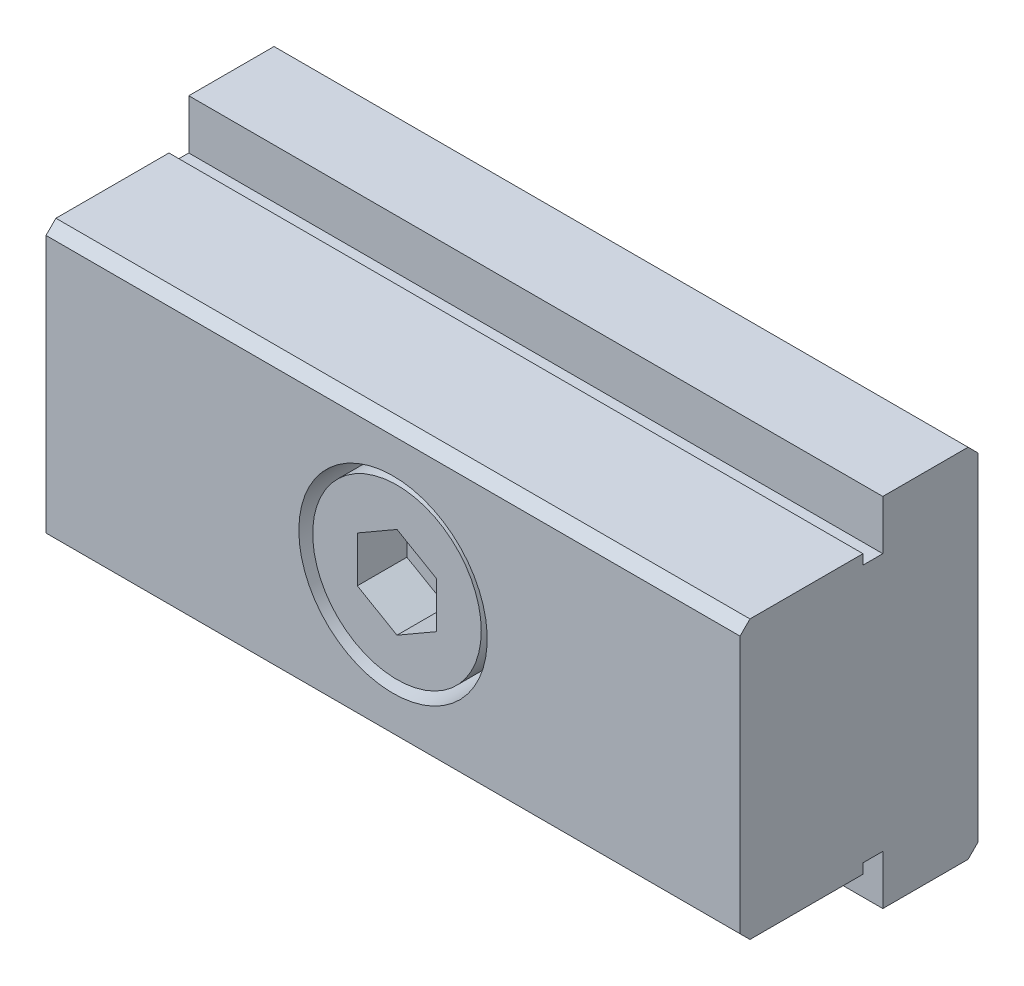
ISO-10303-21;
HEADER;
FILE_DESCRIPTION(('STEP AP214'),'2;1');
FILE_NAME('part.step','',(''),(''),'','','');
FILE_SCHEMA(('AUTOMOTIVE_DESIGN { 1 0 10303 214 1 1 1 1 }'));
ENDSEC;
DATA;
#1=APPLICATION_CONTEXT('core data for automotive mechanical design processes');
#2=APPLICATION_PROTOCOL_DEFINITION('international standard','automotive_design',2000,#1);
#3=PRODUCT_CONTEXT('',#1,'mechanical');
#4=PRODUCT('Part','Part','',(#3));
#5=PRODUCT_RELATED_PRODUCT_CATEGORY('part','',(#4));
#6=PRODUCT_DEFINITION_FORMATION('','',#4);
#7=PRODUCT_DEFINITION_CONTEXT('part definition',#1,'design');
#8=PRODUCT_DEFINITION('design','',#6,#7);
#9=PRODUCT_DEFINITION_SHAPE('','',#8);
#10=(LENGTH_UNIT() NAMED_UNIT(*) SI_UNIT(.MILLI.,.METRE.));
#11=(NAMED_UNIT(*) PLANE_ANGLE_UNIT() SI_UNIT($,.RADIAN.));
#12=(NAMED_UNIT(*) SI_UNIT($,.STERADIAN.) SOLID_ANGLE_UNIT());
#13=UNCERTAINTY_MEASURE_WITH_UNIT(LENGTH_MEASURE(1.E-05),#10,'distance_accuracy_value','');
#14=(GEOMETRIC_REPRESENTATION_CONTEXT(3) GLOBAL_UNCERTAINTY_ASSIGNED_CONTEXT((#13)) GLOBAL_UNIT_ASSIGNED_CONTEXT((#10,
#11,#12)) REPRESENTATION_CONTEXT('',''));
#15=CARTESIAN_POINT('',(0.,0.,0.));
#16=DIRECTION('',(0.,0.,1.));
#17=DIRECTION('',(1.,0.,0.));
#18=AXIS2_PLACEMENT_3D('',#15,#16,#17);
#19=CARTESIAN_POINT('',(17.5,6.5,7.2));
#20=DIRECTION('',(0.,-0.707106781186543,-0.707106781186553));
#21=DIRECTION('',(0.,0.707106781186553,-0.707106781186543));
#22=AXIS2_PLACEMENT_3D('',#19,#20,#21);
#23=PLANE('',#22);
#24=DIRECTION('',(0.,-0.707106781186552,0.707106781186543));
#25=VECTOR('',#24,1.);
#26=CARTESIAN_POINT('',(-17.5,6.5,7.2));
#27=LINE('',#26,#25);
#28=CARTESIAN_POINT('',(-17.5,7.,6.7));
#29=VERTEX_POINT('',#28);
#30=CARTESIAN_POINT('',(-17.5,6.5,7.2));
#31=VERTEX_POINT('',#30);
#32=EDGE_CURVE('E310',#29,#31,#27,.T.);
#33=ORIENTED_EDGE('',*,*,#32,.T.);
#34=DIRECTION('',(-1.,0.,0.));
#35=VECTOR('',#34,1.);
#36=CARTESIAN_POINT('',(17.5,6.5,7.2));
#37=LINE('',#36,#35);
#38=CARTESIAN_POINT('',(17.5,6.5,7.2));
#39=VERTEX_POINT('',#38);
#40=EDGE_CURVE('E24',#39,#31,#37,.T.);
#41=ORIENTED_EDGE('',*,*,#40,.F.);
#42=DIRECTION('',(0.,-0.707106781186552,0.707106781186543));
#43=VECTOR('',#42,1.);
#44=CARTESIAN_POINT('',(17.5,6.5,7.2));
#45=LINE('',#44,#43);
#46=CARTESIAN_POINT('',(17.5,7.,6.7));
#47=VERTEX_POINT('',#46);
#48=EDGE_CURVE('E341',#47,#39,#45,.T.);
#49=ORIENTED_EDGE('',*,*,#48,.F.);
#50=DIRECTION('',(-1.,0.,0.));
#51=VECTOR('',#50,1.);
#52=CARTESIAN_POINT('',(17.5,7.,6.7));
#53=LINE('',#52,#51);
#54=EDGE_CURVE('E197',#47,#29,#53,.T.);
#55=ORIENTED_EDGE('',*,*,#54,.T.);
#56=EDGE_LOOP('',(#33,#41,#49,#55));
#57=FACE_BOUND('',#56,.T.);
#58=ADVANCED_FACE('F14',(#57),#23,.F.);
#59=CARTESIAN_POINT('',(17.5,6.5,7.2));
#60=DIRECTION('',(0.,0.,-1.));
#61=DIRECTION('',(-1.,0.,0.));
#62=AXIS2_PLACEMENT_3D('',#59,#60,#61);
#63=PLANE('',#62);
#64=CARTESIAN_POINT('',(0.,0.,7.2));
#65=DIRECTION('',(0.,0.,-1.));
#66=DIRECTION('',(-1.,0.,0.));
#67=AXIS2_PLACEMENT_3D('',#64,#65,#66);
#68=CIRCLE('',#67,4.75);
#69=CARTESIAN_POINT('',(-4.75,0.,7.2));
#70=VERTEX_POINT('',#69);
#71=EDGE_CURVE('E307',#70,#70,#68,.T.);
#72=ORIENTED_EDGE('',*,*,#71,.T.);
#73=EDGE_LOOP('',(#72));
#74=FACE_BOUND('',#73,.T.);
#75=DIRECTION('',(0.,-1.,0.));
#76=VECTOR('',#75,1.);
#77=CARTESIAN_POINT('',(-17.5,6.5,7.2));
#78=LINE('',#77,#76);
#79=CARTESIAN_POINT('',(-17.5,-6.5,7.2));
#80=VERTEX_POINT('',#79);
#81=EDGE_CURVE('E86',#31,#80,#78,.T.);
#82=ORIENTED_EDGE('',*,*,#81,.T.);
#83=DIRECTION('',(-1.,0.,0.));
#84=VECTOR('',#83,1.);
#85=CARTESIAN_POINT('',(17.5,-6.5,7.2));
#86=LINE('',#85,#84);
#87=CARTESIAN_POINT('',(17.5,-6.5,7.2));
#88=VERTEX_POINT('',#87);
#89=EDGE_CURVE('E235',#88,#80,#86,.T.);
#90=ORIENTED_EDGE('',*,*,#89,.F.);
#91=DIRECTION('',(0.,-1.,0.));
#92=VECTOR('',#91,1.);
#93=CARTESIAN_POINT('',(17.5,6.5,7.2));
#94=LINE('',#93,#92);
#95=EDGE_CURVE('E343',#39,#88,#94,.T.);
#96=ORIENTED_EDGE('',*,*,#95,.F.);
#97=ORIENTED_EDGE('',*,*,#40,.T.);
#98=EDGE_LOOP('',(#82,#90,#96,#97));
#99=FACE_BOUND('',#98,.T.);
#100=ADVANCED_FACE('F385',(#74,#99),#63,.F.);
#101=CARTESIAN_POINT('',(17.5,-6.5,7.2));
#102=DIRECTION('',(0.,0.707106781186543,-0.707106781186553));
#103=DIRECTION('',(0.,0.707106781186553,0.707106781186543));
#104=AXIS2_PLACEMENT_3D('',#101,#102,#103);
#105=PLANE('',#104);
#106=DIRECTION('',(0.,-0.707106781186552,-0.707106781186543));
#107=VECTOR('',#106,1.);
#108=CARTESIAN_POINT('',(-17.5,-6.5,7.2));
#109=LINE('',#108,#107);
#110=CARTESIAN_POINT('',(-17.5,-7.,6.7));
#111=VERTEX_POINT('',#110);
#112=EDGE_CURVE('E314',#80,#111,#109,.T.);
#113=ORIENTED_EDGE('',*,*,#112,.T.);
#114=DIRECTION('',(-1.,0.,0.));
#115=VECTOR('',#114,1.);
#116=CARTESIAN_POINT('',(17.5,-7.,6.7));
#117=LINE('',#116,#115);
#118=CARTESIAN_POINT('',(17.5,-7.,6.7));
#119=VERTEX_POINT('',#118);
#120=EDGE_CURVE('E232',#119,#111,#117,.T.);
#121=ORIENTED_EDGE('',*,*,#120,.F.);
#122=DIRECTION('',(0.,-0.707106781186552,-0.707106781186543));
#123=VECTOR('',#122,1.);
#124=CARTESIAN_POINT('',(17.5,-6.5,7.2));
#125=LINE('',#124,#123);
#126=EDGE_CURVE('E345',#88,#119,#125,.T.);
#127=ORIENTED_EDGE('',*,*,#126,.F.);
#128=ORIENTED_EDGE('',*,*,#89,.T.);
#129=EDGE_LOOP('',(#113,#121,#127,#128));
#130=FACE_BOUND('',#129,.T.);
#131=ADVANCED_FACE('F387',(#130),#105,.F.);
#132=CARTESIAN_POINT('',(17.5,-7.,6.7));
#133=DIRECTION('',(0.,1.,0.));
#134=DIRECTION('',(-1.,0.,0.));
#135=AXIS2_PLACEMENT_3D('',#132,#133,#134);
#136=PLANE('',#135);
#137=DIRECTION('',(0.,0.,-1.));
#138=VECTOR('',#137,1.);
#139=CARTESIAN_POINT('',(-17.5,-7.,6.7));
#140=LINE('',#139,#138);
#141=CARTESIAN_POINT('',(-17.5,-7.,1.));
#142=VERTEX_POINT('',#141);
#143=EDGE_CURVE('E316',#111,#142,#140,.T.);
#144=ORIENTED_EDGE('',*,*,#143,.T.);
#145=DIRECTION('',(-1.,0.,0.));
#146=VECTOR('',#145,1.);
#147=CARTESIAN_POINT('',(17.5,-7.,1.));
#148=LINE('',#147,#146);
#149=CARTESIAN_POINT('',(17.5,-7.,1.));
#150=VERTEX_POINT('',#149);
#151=EDGE_CURVE('E229',#150,#142,#148,.T.);
#152=ORIENTED_EDGE('',*,*,#151,.F.);
#153=DIRECTION('',(0.,0.,-1.));
#154=VECTOR('',#153,1.);
#155=CARTESIAN_POINT('',(17.5,-7.,6.7));
#156=LINE('',#155,#154);
#157=EDGE_CURVE('E347',#119,#150,#156,.T.);
#158=ORIENTED_EDGE('',*,*,#157,.F.);
#159=ORIENTED_EDGE('',*,*,#120,.T.);
#160=EDGE_LOOP('',(#144,#152,#158,#159));
#161=FACE_BOUND('',#160,.T.);
#162=ADVANCED_FACE('F392',(#161),#136,.F.);
#163=CARTESIAN_POINT('',(17.5,-7.,1.));
#164=DIRECTION('',(0.,0.,1.));
#165=DIRECTION('',(1.,0.,0.));
#166=AXIS2_PLACEMENT_3D('',#163,#164,#165);
#167=PLANE('',#166);
#168=DIRECTION('',(0.,1.,0.));
#169=VECTOR('',#168,1.);
#170=CARTESIAN_POINT('',(-17.5,-7.,1.));
#171=LINE('',#170,#169);
#172=CARTESIAN_POINT('',(-17.5,-6.5,1.));
#173=VERTEX_POINT('',#172);
#174=EDGE_CURVE('E318',#142,#173,#171,.T.);
#175=ORIENTED_EDGE('',*,*,#174,.T.);
#176=DIRECTION('',(-1.,0.,0.));
#177=VECTOR('',#176,1.);
#178=CARTESIAN_POINT('',(17.5,-6.5,1.));
#179=LINE('',#178,#177);
#180=CARTESIAN_POINT('',(17.5,-6.5,1.));
#181=VERTEX_POINT('',#180);
#182=EDGE_CURVE('E226',#181,#173,#179,.T.);
#183=ORIENTED_EDGE('',*,*,#182,.F.);
#184=DIRECTION('',(0.,1.,0.));
#185=VECTOR('',#184,1.);
#186=CARTESIAN_POINT('',(17.5,-7.,1.));
#187=LINE('',#186,#185);
#188=EDGE_CURVE('E349',#150,#181,#187,.T.);
#189=ORIENTED_EDGE('',*,*,#188,.F.);
#190=ORIENTED_EDGE('',*,*,#151,.T.);
#191=EDGE_LOOP('',(#175,#183,#189,#190));
#192=FACE_BOUND('',#191,.T.);
#193=ADVANCED_FACE('F398',(#192),#167,.F.);
#194=CARTESIAN_POINT('',(17.5,-6.5,1.));
#195=DIRECTION('',(0.,1.,0.));
#196=DIRECTION('',(-1.,0.,0.));
#197=AXIS2_PLACEMENT_3D('',#194,#195,#196);
#198=PLANE('',#197);
#199=DIRECTION('',(0.,0.,-1.));
#200=VECTOR('',#199,1.);
#201=CARTESIAN_POINT('',(-17.5,-6.5,1.));
#202=LINE('',#201,#200);
#203=CARTESIAN_POINT('',(-17.5,-6.5,0.));
#204=VERTEX_POINT('',#203);
#205=EDGE_CURVE('E320',#173,#204,#202,.T.);
#206=ORIENTED_EDGE('',*,*,#205,.T.);
#207=DIRECTION('',(-1.,0.,0.));
#208=VECTOR('',#207,1.);
#209=CARTESIAN_POINT('',(17.5,-6.5,0.));
#210=LINE('',#209,#208);
#211=CARTESIAN_POINT('',(17.5,-6.5,0.));
#212=VERTEX_POINT('',#211);
#213=EDGE_CURVE('E223',#212,#204,#210,.T.);
#214=ORIENTED_EDGE('',*,*,#213,.F.);
#215=DIRECTION('',(0.,0.,-1.));
#216=VECTOR('',#215,1.);
#217=CARTESIAN_POINT('',(17.5,-6.5,1.));
#218=LINE('',#217,#216);
#219=EDGE_CURVE('E351',#181,#212,#218,.T.);
#220=ORIENTED_EDGE('',*,*,#219,.F.);
#221=ORIENTED_EDGE('',*,*,#182,.T.);
#222=EDGE_LOOP('',(#206,#214,#220,#221));
#223=FACE_BOUND('',#222,.T.);
#224=ADVANCED_FACE('F402',(#223),#198,.F.);
#225=CARTESIAN_POINT('',(17.5,-6.5,0.));
#226=DIRECTION('',(0.,0.,-1.));
#227=DIRECTION('',(-1.,0.,0.));
#228=AXIS2_PLACEMENT_3D('',#225,#226,#227);
#229=PLANE('',#228);
#230=DIRECTION('',(0.,-1.,0.));
#231=VECTOR('',#230,1.);
#232=CARTESIAN_POINT('',(-17.5,-6.5,0.));
#233=LINE('',#232,#231);
#234=CARTESIAN_POINT('',(-17.5,-9.,0.));
#235=VERTEX_POINT('',#234);
#236=EDGE_CURVE('E322',#204,#235,#233,.T.);
#237=ORIENTED_EDGE('',*,*,#236,.T.);
#238=DIRECTION('',(-1.,0.,0.));
#239=VECTOR('',#238,1.);
#240=CARTESIAN_POINT('',(17.5,-9.,0.));
#241=LINE('',#240,#239);
#242=CARTESIAN_POINT('',(17.5,-9.,0.));
#243=VERTEX_POINT('',#242);
#244=EDGE_CURVE('E220',#243,#235,#241,.T.);
#245=ORIENTED_EDGE('',*,*,#244,.F.);
#246=DIRECTION('',(0.,-1.,0.));
#247=VECTOR('',#246,1.);
#248=CARTESIAN_POINT('',(17.5,-6.5,0.));
#249=LINE('',#248,#247);
#250=EDGE_CURVE('E353',#212,#243,#249,.T.);
#251=ORIENTED_EDGE('',*,*,#250,.F.);
#252=ORIENTED_EDGE('',*,*,#213,.T.);
#253=EDGE_LOOP('',(#237,#245,#251,#252));
#254=FACE_BOUND('',#253,.T.);
#255=ADVANCED_FACE('F407',(#254),#229,.F.);
#256=CARTESIAN_POINT('',(17.5,-9.,0.));
#257=DIRECTION('',(0.,1.,0.));
#258=DIRECTION('',(-1.,0.,0.));
#259=AXIS2_PLACEMENT_3D('',#256,#257,#258);
#260=PLANE('',#259);
#261=DIRECTION('',(0.,0.,-1.));
#262=VECTOR('',#261,1.);
#263=CARTESIAN_POINT('',(-17.5,-9.,0.));
#264=LINE('',#263,#262);
#265=CARTESIAN_POINT('',(-17.5,-9.,-4.3));
#266=VERTEX_POINT('',#265);
#267=EDGE_CURVE('E324',#235,#266,#264,.T.);
#268=ORIENTED_EDGE('',*,*,#267,.T.);
#269=DIRECTION('',(-1.,0.,0.));
#270=VECTOR('',#269,1.);
#271=CARTESIAN_POINT('',(17.5,-9.,-4.3));
#272=LINE('',#271,#270);
#273=CARTESIAN_POINT('',(17.5,-9.,-4.3));
#274=VERTEX_POINT('',#273);
#275=EDGE_CURVE('E217',#274,#266,#272,.T.);
#276=ORIENTED_EDGE('',*,*,#275,.F.);
#277=DIRECTION('',(0.,0.,-1.));
#278=VECTOR('',#277,1.);
#279=CARTESIAN_POINT('',(17.5,-9.,0.));
#280=LINE('',#279,#278);
#281=EDGE_CURVE('E355',#243,#274,#280,.T.);
#282=ORIENTED_EDGE('',*,*,#281,.F.);
#283=ORIENTED_EDGE('',*,*,#244,.T.);
#284=EDGE_LOOP('',(#268,#276,#282,#283));
#285=FACE_BOUND('',#284,.T.);
#286=ADVANCED_FACE('F413',(#285),#260,.F.);
#287=CARTESIAN_POINT('',(17.5,-9.,-4.3));
#288=DIRECTION('',(0.,0.707106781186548,0.707106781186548));
#289=DIRECTION('',(0.,-0.707106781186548,0.707106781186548));
#290=AXIS2_PLACEMENT_3D('',#287,#288,#289);
#291=PLANE('',#290);
#292=DIRECTION('',(0.,0.707106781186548,-0.707106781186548));
#293=VECTOR('',#292,1.);
#294=CARTESIAN_POINT('',(-17.5,-9.,-4.3));
#295=LINE('',#294,#293);
#296=CARTESIAN_POINT('',(-17.5,-8.5,-4.8));
#297=VERTEX_POINT('',#296);
#298=EDGE_CURVE('E326',#266,#297,#295,.T.);
#299=ORIENTED_EDGE('',*,*,#298,.T.);
#300=DIRECTION('',(-1.,0.,0.));
#301=VECTOR('',#300,1.);
#302=CARTESIAN_POINT('',(17.5,-8.5,-4.8));
#303=LINE('',#302,#301);
#304=CARTESIAN_POINT('',(17.5,-8.5,-4.8));
#305=VERTEX_POINT('',#304);
#306=EDGE_CURVE('E214',#305,#297,#303,.T.);
#307=ORIENTED_EDGE('',*,*,#306,.F.);
#308=DIRECTION('',(0.,0.707106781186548,-0.707106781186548));
#309=VECTOR('',#308,1.);
#310=CARTESIAN_POINT('',(17.5,-9.,-4.3));
#311=LINE('',#310,#309);
#312=EDGE_CURVE('E357',#274,#305,#311,.T.);
#313=ORIENTED_EDGE('',*,*,#312,.F.);
#314=ORIENTED_EDGE('',*,*,#275,.T.);
#315=EDGE_LOOP('',(#299,#307,#313,#314));
#316=FACE_BOUND('',#315,.T.);
#317=ADVANCED_FACE('F417',(#316),#291,.F.);
#318=CARTESIAN_POINT('',(17.5,8.5,-4.8));
#319=DIRECTION('',(0.,0.,1.));
#320=DIRECTION('',(1.,0.,0.));
#321=AXIS2_PLACEMENT_3D('',#318,#319,#320);
#322=PLANE('',#321);
#323=CARTESIAN_POINT('',(0.,0.,-4.8));
#324=DIRECTION('',(0.,0.,-1.));
#325=DIRECTION('',(-1.,0.,0.));
#326=AXIS2_PLACEMENT_3D('',#323,#324,#325);
#327=CIRCLE('',#326,2.75);
#328=CARTESIAN_POINT('',(-2.75,0.,-4.8));
#329=VERTEX_POINT('',#328);
#330=EDGE_CURVE('E293',#329,#329,#327,.T.);
#331=ORIENTED_EDGE('',*,*,#330,.F.);
#332=EDGE_LOOP('',(#331));
#333=FACE_BOUND('',#332,.T.);
#334=DIRECTION('',(0.,1.,0.));
#335=VECTOR('',#334,1.);
#336=CARTESIAN_POINT('',(-17.5,8.5,-4.8));
#337=LINE('',#336,#335);
#338=CARTESIAN_POINT('',(-17.5,8.5,-4.8));
#339=VERTEX_POINT('',#338);
#340=EDGE_CURVE('E328',#297,#339,#337,.T.);
#341=ORIENTED_EDGE('',*,*,#340,.T.);
#342=DIRECTION('',(-1.,0.,0.));
#343=VECTOR('',#342,1.);
#344=CARTESIAN_POINT('',(17.5,8.5,-4.8));
#345=LINE('',#344,#343);
#346=CARTESIAN_POINT('',(17.5,8.5,-4.8));
#347=VERTEX_POINT('',#346);
#348=EDGE_CURVE('E211',#347,#339,#345,.T.);
#349=ORIENTED_EDGE('',*,*,#348,.F.);
#350=DIRECTION('',(0.,1.,0.));
#351=VECTOR('',#350,1.);
#352=CARTESIAN_POINT('',(17.5,8.5,-4.8));
#353=LINE('',#352,#351);
#354=EDGE_CURVE('E359',#305,#347,#353,.T.);
#355=ORIENTED_EDGE('',*,*,#354,.F.);
#356=ORIENTED_EDGE('',*,*,#306,.T.);
#357=EDGE_LOOP('',(#341,#349,#355,#356));
#358=FACE_BOUND('',#357,.T.);
#359=ADVANCED_FACE('F422',(#333,#358),#322,.F.);
#360=CARTESIAN_POINT('',(17.5,9.,-4.3));
#361=DIRECTION('',(0.,-0.707106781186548,0.707106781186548));
#362=DIRECTION('',(0.,-0.707106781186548,-0.707106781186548));
#363=AXIS2_PLACEMENT_3D('',#360,#361,#362);
#364=PLANE('',#363);
#365=DIRECTION('',(0.,0.707106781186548,0.707106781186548));
#366=VECTOR('',#365,1.);
#367=CARTESIAN_POINT('',(-17.5,9.,-4.3));
#368=LINE('',#367,#366);
#369=CARTESIAN_POINT('',(-17.5,9.,-4.3));
#370=VERTEX_POINT('',#369);
#371=EDGE_CURVE('E330',#339,#370,#368,.T.);
#372=ORIENTED_EDGE('',*,*,#371,.T.);
#373=DIRECTION('',(-1.,0.,0.));
#374=VECTOR('',#373,1.);
#375=CARTESIAN_POINT('',(17.5,9.,-4.3));
#376=LINE('',#375,#374);
#377=CARTESIAN_POINT('',(17.5,9.,-4.3));
#378=VERTEX_POINT('',#377);
#379=EDGE_CURVE('E208',#378,#370,#376,.T.);
#380=ORIENTED_EDGE('',*,*,#379,.F.);
#381=DIRECTION('',(0.,0.707106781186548,0.707106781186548));
#382=VECTOR('',#381,1.);
#383=CARTESIAN_POINT('',(17.5,9.,-4.3));
#384=LINE('',#383,#382);
#385=EDGE_CURVE('E361',#347,#378,#384,.T.);
#386=ORIENTED_EDGE('',*,*,#385,.F.);
#387=ORIENTED_EDGE('',*,*,#348,.T.);
#388=EDGE_LOOP('',(#372,#380,#386,#387));
#389=FACE_BOUND('',#388,.T.);
#390=ADVANCED_FACE('F425',(#389),#364,.F.);
#391=CARTESIAN_POINT('',(17.5,9.,0.));
#392=DIRECTION('',(0.,-1.,0.));
#393=DIRECTION('',(1.,0.,0.));
#394=AXIS2_PLACEMENT_3D('',#391,#392,#393);
#395=PLANE('',#394);
#396=DIRECTION('',(0.,0.,1.));
#397=VECTOR('',#396,1.);
#398=CARTESIAN_POINT('',(-17.5,9.,0.));
#399=LINE('',#398,#397);
#400=CARTESIAN_POINT('',(-17.5,9.,0.));
#401=VERTEX_POINT('',#400);
#402=EDGE_CURVE('E332',#370,#401,#399,.T.);
#403=ORIENTED_EDGE('',*,*,#402,.T.);
#404=DIRECTION('',(-1.,0.,0.));
#405=VECTOR('',#404,1.);
#406=CARTESIAN_POINT('',(17.5,9.,0.));
#407=LINE('',#406,#405);
#408=CARTESIAN_POINT('',(17.5,9.,0.));
#409=VERTEX_POINT('',#408);
#410=EDGE_CURVE('E205',#409,#401,#407,.T.);
#411=ORIENTED_EDGE('',*,*,#410,.F.);
#412=DIRECTION('',(0.,0.,1.));
#413=VECTOR('',#412,1.);
#414=CARTESIAN_POINT('',(17.5,9.,0.));
#415=LINE('',#414,#413);
#416=EDGE_CURVE('E363',#378,#409,#415,.T.);
#417=ORIENTED_EDGE('',*,*,#416,.F.);
#418=ORIENTED_EDGE('',*,*,#379,.T.);
#419=EDGE_LOOP('',(#403,#411,#417,#418));
#420=FACE_BOUND('',#419,.T.);
#421=ADVANCED_FACE('F369',(#420),#395,.F.);
#422=CARTESIAN_POINT('',(17.5,6.5,0.));
#423=DIRECTION('',(0.,0.,-1.));
#424=DIRECTION('',(-1.,0.,0.));
#425=AXIS2_PLACEMENT_3D('',#422,#423,#424);
#426=PLANE('',#425);
#427=DIRECTION('',(0.,-1.,0.));
#428=VECTOR('',#427,1.);
#429=CARTESIAN_POINT('',(-17.5,6.5,0.));
#430=LINE('',#429,#428);
#431=CARTESIAN_POINT('',(-17.5,6.5,0.));
#432=VERTEX_POINT('',#431);
#433=EDGE_CURVE('E334',#401,#432,#430,.T.);
#434=ORIENTED_EDGE('',*,*,#433,.T.);
#435=DIRECTION('',(-1.,0.,0.));
#436=VECTOR('',#435,1.);
#437=CARTESIAN_POINT('',(17.5,6.5,0.));
#438=LINE('',#437,#436);
#439=CARTESIAN_POINT('',(17.5,6.5,0.));
#440=VERTEX_POINT('',#439);
#441=EDGE_CURVE('E191',#440,#432,#438,.T.);
#442=ORIENTED_EDGE('',*,*,#441,.F.);
#443=DIRECTION('',(0.,-1.,0.));
#444=VECTOR('',#443,1.);
#445=CARTESIAN_POINT('',(17.5,6.5,0.));
#446=LINE('',#445,#444);
#447=EDGE_CURVE('E179',#409,#440,#446,.T.);
#448=ORIENTED_EDGE('',*,*,#447,.F.);
#449=ORIENTED_EDGE('',*,*,#410,.T.);
#450=EDGE_LOOP('',(#434,#442,#448,#449));
#451=FACE_BOUND('',#450,.T.);
#452=ADVANCED_FACE('F373',(#451),#426,.F.);
#453=CARTESIAN_POINT('',(17.5,6.5,1.));
#454=DIRECTION('',(0.,-1.,0.));
#455=DIRECTION('',(1.,0.,0.));
#456=AXIS2_PLACEMENT_3D('',#453,#454,#455);
#457=PLANE('',#456);
#458=DIRECTION('',(0.,0.,1.));
#459=VECTOR('',#458,1.);
#460=CARTESIAN_POINT('',(-17.5,6.5,1.));
#461=LINE('',#460,#459);
#462=CARTESIAN_POINT('',(-17.5,6.5,1.));
#463=VERTEX_POINT('',#462);
#464=EDGE_CURVE('E188',#432,#463,#461,.T.);
#465=ORIENTED_EDGE('',*,*,#464,.T.);
#466=DIRECTION('',(-1.,0.,0.));
#467=VECTOR('',#466,1.);
#468=CARTESIAN_POINT('',(17.5,6.5,1.));
#469=LINE('',#468,#467);
#470=CARTESIAN_POINT('',(17.5,6.5,1.));
#471=VERTEX_POINT('',#470);
#472=EDGE_CURVE('E185',#471,#463,#469,.T.);
#473=ORIENTED_EDGE('',*,*,#472,.F.);
#474=DIRECTION('',(0.,0.,1.));
#475=VECTOR('',#474,1.);
#476=CARTESIAN_POINT('',(17.5,6.5,1.));
#477=LINE('',#476,#475);
#478=EDGE_CURVE('E172',#440,#471,#477,.T.);
#479=ORIENTED_EDGE('',*,*,#478,.F.);
#480=ORIENTED_EDGE('',*,*,#441,.T.);
#481=EDGE_LOOP('',(#465,#473,#479,#480));
#482=FACE_BOUND('',#481,.T.);
#483=ADVANCED_FACE('F186',(#482),#457,.F.);
#484=CARTESIAN_POINT('',(17.5,7.,1.));
#485=DIRECTION('',(0.,0.,1.));
#486=DIRECTION('',(1.,0.,0.));
#487=AXIS2_PLACEMENT_3D('',#484,#485,#486);
#488=PLANE('',#487);
#489=DIRECTION('',(0.,1.,0.));
#490=VECTOR('',#489,1.);
#491=CARTESIAN_POINT('',(-17.5,7.,1.));
#492=LINE('',#491,#490);
#493=CARTESIAN_POINT('',(-17.5,7.,1.));
#494=VERTEX_POINT('',#493);
#495=EDGE_CURVE('E337',#463,#494,#492,.T.);
#496=ORIENTED_EDGE('',*,*,#495,.T.);
#497=DIRECTION('',(-1.,0.,0.));
#498=VECTOR('',#497,1.);
#499=CARTESIAN_POINT('',(17.5,7.,1.));
#500=LINE('',#499,#498);
#501=CARTESIAN_POINT('',(17.5,7.,1.));
#502=VERTEX_POINT('',#501);
#503=EDGE_CURVE('E192',#502,#494,#500,.T.);
#504=ORIENTED_EDGE('',*,*,#503,.F.);
#505=DIRECTION('',(0.,1.,0.));
#506=VECTOR('',#505,1.);
#507=CARTESIAN_POINT('',(17.5,7.,1.));
#508=LINE('',#507,#506);
#509=EDGE_CURVE('E176',#471,#502,#508,.T.);
#510=ORIENTED_EDGE('',*,*,#509,.F.);
#511=ORIENTED_EDGE('',*,*,#472,.T.);
#512=EDGE_LOOP('',(#496,#504,#510,#511));
#513=FACE_BOUND('',#512,.T.);
#514=ADVANCED_FACE('F194',(#513),#488,.F.);
#515=CARTESIAN_POINT('',(17.5,7.,6.7));
#516=DIRECTION('',(0.,-1.,0.));
#517=DIRECTION('',(1.,0.,0.));
#518=AXIS2_PLACEMENT_3D('',#515,#516,#517);
#519=PLANE('',#518);
#520=DIRECTION('',(0.,0.,1.));
#521=VECTOR('',#520,1.);
#522=CARTESIAN_POINT('',(-17.5,7.,6.7));
#523=LINE('',#522,#521);
#524=EDGE_CURVE('E339',#494,#29,#523,.T.);
#525=ORIENTED_EDGE('',*,*,#524,.T.);
#526=ORIENTED_EDGE('',*,*,#54,.F.);
#527=DIRECTION('',(0.,0.,1.));
#528=VECTOR('',#527,1.);
#529=CARTESIAN_POINT('',(17.5,7.,6.7));
#530=LINE('',#529,#528);
#531=EDGE_CURVE('E33',#502,#47,#530,.T.);
#532=ORIENTED_EDGE('',*,*,#531,.F.);
#533=ORIENTED_EDGE('',*,*,#503,.T.);
#534=EDGE_LOOP('',(#525,#526,#532,#533));
#535=FACE_BOUND('',#534,.T.);
#536=ADVANCED_FACE('F377',(#535),#519,.F.);
#537=CARTESIAN_POINT('',(17.5,13.5,0.200000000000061));
#538=DIRECTION('',(-1.,0.,0.));
#539=DIRECTION('',(0.,-1.,0.));
#540=AXIS2_PLACEMENT_3D('',#537,#538,#539);
#541=PLANE('',#540);
#542=ORIENTED_EDGE('',*,*,#48,.T.);
#543=ORIENTED_EDGE('',*,*,#95,.T.);
#544=ORIENTED_EDGE('',*,*,#126,.T.);
#545=ORIENTED_EDGE('',*,*,#157,.T.);
#546=ORIENTED_EDGE('',*,*,#188,.T.);
#547=ORIENTED_EDGE('',*,*,#219,.T.);
#548=ORIENTED_EDGE('',*,*,#250,.T.);
#549=ORIENTED_EDGE('',*,*,#281,.T.);
#550=ORIENTED_EDGE('',*,*,#312,.T.);
#551=ORIENTED_EDGE('',*,*,#354,.T.);
#552=ORIENTED_EDGE('',*,*,#385,.T.);
#553=ORIENTED_EDGE('',*,*,#416,.T.);
#554=ORIENTED_EDGE('',*,*,#447,.T.);
#555=ORIENTED_EDGE('',*,*,#478,.T.);
#556=ORIENTED_EDGE('',*,*,#509,.T.);
#557=ORIENTED_EDGE('',*,*,#531,.T.);
#558=EDGE_LOOP('',(#542,#543,#544,#545,#546,#547,#548,#549,#550,#551,#552,#553,#554,#555,#556,#557));
#559=FACE_BOUND('',#558,.T.);
#560=ADVANCED_FACE('F174',(#559),#541,.F.);
#561=CARTESIAN_POINT('',(-17.5,13.5,0.200000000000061));
#562=DIRECTION('',(-1.,0.,0.));
#563=DIRECTION('',(0.,-1.,0.));
#564=AXIS2_PLACEMENT_3D('',#561,#562,#563);
#565=PLANE('',#564);
#566=ORIENTED_EDGE('',*,*,#32,.F.);
#567=ORIENTED_EDGE('',*,*,#524,.F.);
#568=ORIENTED_EDGE('',*,*,#495,.F.);
#569=ORIENTED_EDGE('',*,*,#464,.F.);
#570=ORIENTED_EDGE('',*,*,#433,.F.);
#571=ORIENTED_EDGE('',*,*,#402,.F.);
#572=ORIENTED_EDGE('',*,*,#371,.F.);
#573=ORIENTED_EDGE('',*,*,#340,.F.);
#574=ORIENTED_EDGE('',*,*,#298,.F.);
#575=ORIENTED_EDGE('',*,*,#267,.F.);
#576=ORIENTED_EDGE('',*,*,#236,.F.);
#577=ORIENTED_EDGE('',*,*,#205,.F.);
#578=ORIENTED_EDGE('',*,*,#174,.F.);
#579=ORIENTED_EDGE('',*,*,#143,.F.);
#580=ORIENTED_EDGE('',*,*,#112,.F.);
#581=ORIENTED_EDGE('',*,*,#81,.F.);
#582=EDGE_LOOP('',(#566,#567,#568,#569,#570,#571,#572,#573,#574,#575,#576,#577,#578,#579,#580,#581));
#583=FACE_BOUND('',#582,.T.);
#584=ADVANCED_FACE('F374',(#583),#565,.T.);
#585=CARTESIAN_POINT('',(0.,0.,-4.8));
#586=DIRECTION('',(0.,0.,-1.));
#587=DIRECTION('',(-1.,0.,0.));
#588=AXIS2_PLACEMENT_3D('',#585,#586,#587);
#589=CYLINDRICAL_SURFACE('',#588,4.75);
#590=ORIENTED_EDGE('',*,*,#71,.F.);
#591=EDGE_LOOP('',(#590));
#592=FACE_BOUND('',#591,.T.);
#593=CARTESIAN_POINT('',(0.,0.,2.));
#594=DIRECTION('',(0.,0.,-1.));
#595=DIRECTION('',(-1.,0.,0.));
#596=AXIS2_PLACEMENT_3D('',#593,#594,#595);
#597=CIRCLE('',#596,4.75);
#598=CARTESIAN_POINT('',(-4.75,0.,2.));
#599=VERTEX_POINT('',#598);
#600=EDGE_CURVE('E302',#599,#599,#597,.T.);
#601=ORIENTED_EDGE('',*,*,#600,.T.);
#602=EDGE_LOOP('',(#601));
#603=FACE_BOUND('',#602,.T.);
#604=ADVANCED_FACE('F681',(#592,#603),#589,.F.);
#605=CARTESIAN_POINT('',(0.,4.75,2.));
#606=DIRECTION('',(0.,0.,-1.));
#607=DIRECTION('',(-1.,0.,0.));
#608=AXIS2_PLACEMENT_3D('',#605,#606,#607);
#609=PLANE('',#608);
#610=CARTESIAN_POINT('',(0.,0.,2.));
#611=DIRECTION('',(0.,0.,-1.));
#612=DIRECTION('',(-1.,0.,0.));
#613=AXIS2_PLACEMENT_3D('',#610,#611,#612);
#614=CIRCLE('',#613,4.25);
#615=CARTESIAN_POINT('',(-4.25,0.,2.));
#616=VERTEX_POINT('',#615);
#617=EDGE_CURVE('E9',#616,#616,#614,.T.);
#618=ORIENTED_EDGE('',*,*,#617,.T.);
#619=EDGE_LOOP('',(#618));
#620=FACE_BOUND('',#619,.T.);
#621=ORIENTED_EDGE('',*,*,#600,.F.);
#622=EDGE_LOOP('',(#621));
#623=FACE_BOUND('',#622,.T.);
#624=ADVANCED_FACE('F455',(#620,#623),#609,.F.);
#625=CARTESIAN_POINT('',(0.,0.,-4.8));
#626=DIRECTION('',(0.,0.,-1.));
#627=DIRECTION('',(-1.,0.,0.));
#628=AXIS2_PLACEMENT_3D('',#625,#626,#627);
#629=CYLINDRICAL_SURFACE('',#628,2.75);
#630=CARTESIAN_POINT('',(0.,0.,2.));
#631=DIRECTION('',(0.,0.,-1.));
#632=DIRECTION('',(-1.,0.,0.));
#633=AXIS2_PLACEMENT_3D('',#630,#631,#632);
#634=CIRCLE('',#633,2.75);
#635=CARTESIAN_POINT('',(-2.75,0.,2.));
#636=VERTEX_POINT('',#635);
#637=EDGE_CURVE('E297',#636,#636,#634,.T.);
#638=ORIENTED_EDGE('',*,*,#637,.F.);
#639=EDGE_LOOP('',(#638));
#640=FACE_BOUND('',#639,.T.);
#641=ORIENTED_EDGE('',*,*,#330,.T.);
#642=EDGE_LOOP('',(#641));
#643=FACE_BOUND('',#642,.T.);
#644=ADVANCED_FACE('F448',(#640,#643),#629,.F.);
#645=CARTESIAN_POINT('',(2.5,0.,-10.));
#646=DIRECTION('',(0.,0.,-1.));
#647=DIRECTION('',(-1.,0.,0.));
#648=AXIS2_PLACEMENT_3D('',#645,#646,#647);
#649=PLANE('',#648);
#650=CARTESIAN_POINT('',(0.,0.,-10.));
#651=DIRECTION('',(0.,0.,-1.));
#652=DIRECTION('',(-1.,0.,0.));
#653=AXIS2_PLACEMENT_3D('',#650,#651,#652);
#654=CIRCLE('',#653,1.6);
#655=CARTESIAN_POINT('',(-1.6,0.,-10.));
#656=VERTEX_POINT('',#655);
#657=EDGE_CURVE('E18',#656,#656,#654,.T.);
#658=ORIENTED_EDGE('',*,*,#657,.T.);
#659=EDGE_LOOP('',(#658));
#660=FACE_BOUND('',#659,.T.);
#661=ADVANCED_FACE('F439',(#660),#649,.T.);
#662=CARTESIAN_POINT('',(0.,0.,-9.1));
#663=DIRECTION('',(0.,0.,1.));
#664=DIRECTION('',(1.,0.,0.));
#665=AXIS2_PLACEMENT_3D('',#662,#663,#664);
#666=CONICAL_SURFACE('',#665,2.5,0.785398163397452);
#667=ORIENTED_EDGE('',*,*,#657,.F.);
#668=EDGE_LOOP('',(#667));
#669=FACE_BOUND('',#668,.T.);
#670=CARTESIAN_POINT('',(0.,0.,-9.1));
#671=DIRECTION('',(0.,0.,-1.));
#672=DIRECTION('',(-1.,0.,0.));
#673=AXIS2_PLACEMENT_3D('',#670,#671,#672);
#674=CIRCLE('',#673,2.5);
#675=CARTESIAN_POINT('',(-2.5,0.,-9.1));
#676=VERTEX_POINT('',#675);
#677=EDGE_CURVE('E288',#676,#676,#674,.F.);
#678=ORIENTED_EDGE('',*,*,#677,.F.);
#679=EDGE_LOOP('',(#678));
#680=FACE_BOUND('',#679,.T.);
#681=ADVANCED_FACE('F16',(#669,#680),#666,.T.);
#682=CARTESIAN_POINT('',(0.,0.,10.));
#683=DIRECTION('',(0.,0.,1.));
#684=DIRECTION('',(1.,0.,0.));
#685=AXIS2_PLACEMENT_3D('',#682,#683,#684);
#686=CYLINDRICAL_SURFACE('',#685,2.5);
#687=ORIENTED_EDGE('',*,*,#677,.T.);
#688=EDGE_LOOP('',(#687));
#689=FACE_BOUND('',#688,.T.);
#690=CARTESIAN_POINT('',(0.,0.,2.));
#691=DIRECTION('',(0.,0.,1.));
#692=DIRECTION('',(1.,0.,0.));
#693=AXIS2_PLACEMENT_3D('',#690,#691,#692);
#694=CIRCLE('',#693,2.5);
#695=CARTESIAN_POINT('',(2.5,0.,2.));
#696=VERTEX_POINT('',#695);
#697=EDGE_CURVE('E283',#696,#696,#694,.T.);
#698=ORIENTED_EDGE('',*,*,#697,.F.);
#699=EDGE_LOOP('',(#698));
#700=FACE_BOUND('',#699,.T.);
#701=ADVANCED_FACE('F438',(#689,#700),#686,.T.);
#702=CARTESIAN_POINT('',(4.25,0.,2.));
#703=DIRECTION('',(0.,0.,-1.));
#704=DIRECTION('',(-1.,0.,0.));
#705=AXIS2_PLACEMENT_3D('',#702,#703,#704);
#706=PLANE('',#705);
#707=ORIENTED_EDGE('',*,*,#697,.T.);
#708=EDGE_LOOP('',(#707));
#709=FACE_BOUND('',#708,.T.);
#710=ORIENTED_EDGE('',*,*,#637,.T.);
#711=EDGE_LOOP('',(#710));
#712=FACE_BOUND('',#711,.T.);
#713=ADVANCED_FACE('F446',(#709,#712),#706,.T.);
#714=CARTESIAN_POINT('',(-2.,3.46410161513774,4.5));
#715=DIRECTION('',(0.,0.,-1.));
#716=DIRECTION('',(-1.,0.,0.));
#717=AXIS2_PLACEMENT_3D('',#714,#715,#716);
#718=PLANE('',#717);
#719=DIRECTION('',(0.86602540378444,-0.5,0.));
#720=VECTOR('',#719,1.);
#721=CARTESIAN_POINT('',(0.,2.3094010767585,4.5));
#722=LINE('',#721,#720);
#723=CARTESIAN_POINT('',(0.,2.3094010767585,4.5));
#724=VERTEX_POINT('',#723);
#725=CARTESIAN_POINT('',(2.,1.15470053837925,4.5));
#726=VERTEX_POINT('',#725);
#727=EDGE_CURVE('E242',#724,#726,#722,.T.);
#728=ORIENTED_EDGE('',*,*,#727,.F.);
#729=DIRECTION('',(-0.86602540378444,-0.5,0.));
#730=VECTOR('',#729,1.);
#731=CARTESIAN_POINT('',(0.,2.3094010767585,4.5));
#732=LINE('',#731,#730);
#733=CARTESIAN_POINT('',(-2.,1.15470053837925,4.5));
#734=VERTEX_POINT('',#733);
#735=EDGE_CURVE('E256',#724,#734,#732,.T.);
#736=ORIENTED_EDGE('',*,*,#735,.T.);
#737=DIRECTION('',(0.,-1.,0.));
#738=VECTOR('',#737,1.);
#739=CARTESIAN_POINT('',(-2.,1.15470053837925,4.5));
#740=LINE('',#739,#738);
#741=CARTESIAN_POINT('',(-2.,-1.15470053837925,4.5));
#742=VERTEX_POINT('',#741);
#743=EDGE_CURVE('E259',#734,#742,#740,.T.);
#744=ORIENTED_EDGE('',*,*,#743,.T.);
#745=DIRECTION('',(-0.86602540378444,0.5,0.));
#746=VECTOR('',#745,1.);
#747=CARTESIAN_POINT('',(0.,-2.3094010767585,4.5));
#748=LINE('',#747,#746);
#749=CARTESIAN_POINT('',(0.,-2.3094010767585,4.5));
#750=VERTEX_POINT('',#749);
#751=EDGE_CURVE('E262',#750,#742,#748,.T.);
#752=ORIENTED_EDGE('',*,*,#751,.F.);
#753=DIRECTION('',(0.86602540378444,0.5,0.));
#754=VECTOR('',#753,1.);
#755=CARTESIAN_POINT('',(0.,-2.3094010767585,4.5));
#756=LINE('',#755,#754);
#757=CARTESIAN_POINT('',(2.,-1.15470053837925,4.5));
#758=VERTEX_POINT('',#757);
#759=EDGE_CURVE('E265',#750,#758,#756,.T.);
#760=ORIENTED_EDGE('',*,*,#759,.T.);
#761=DIRECTION('',(0.,1.,0.));
#762=VECTOR('',#761,1.);
#763=CARTESIAN_POINT('',(2.,-1.15470053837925,4.5));
#764=LINE('',#763,#762);
#765=EDGE_CURVE('E268',#758,#726,#764,.T.);
#766=ORIENTED_EDGE('',*,*,#765,.T.);
#767=EDGE_LOOP('',(#728,#736,#744,#752,#760,#766));
#768=FACE_BOUND('',#767,.T.);
#769=ADVANCED_FACE('F465',(#768),#718,.F.);
#770=CARTESIAN_POINT('',(-2.,1.15470053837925,4.5));
#771=DIRECTION('',(-1.,0.,0.));
#772=DIRECTION('',(0.,-1.,0.));
#773=AXIS2_PLACEMENT_3D('',#770,#771,#772);
#774=PLANE('',#773);
#775=DIRECTION('',(0.,0.,1.));
#776=VECTOR('',#775,1.);
#777=CARTESIAN_POINT('',(-2.,1.15470053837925,4.5));
#778=LINE('',#777,#776);
#779=CARTESIAN_POINT('',(-2.,1.15470053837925,7.));
#780=VERTEX_POINT('',#779);
#781=EDGE_CURVE('E273',#734,#780,#778,.T.);
#782=ORIENTED_EDGE('',*,*,#781,.T.);
#783=DIRECTION('',(0.,-1.,0.));
#784=VECTOR('',#783,1.);
#785=CARTESIAN_POINT('',(-2.,1.15470053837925,7.));
#786=LINE('',#785,#784);
#787=CARTESIAN_POINT('',(-2.,-1.15470053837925,7.));
#788=VERTEX_POINT('',#787);
#789=EDGE_CURVE('E243',#780,#788,#786,.T.);
#790=ORIENTED_EDGE('',*,*,#789,.T.);
#791=DIRECTION('',(0.,0.,1.));
#792=VECTOR('',#791,1.);
#793=CARTESIAN_POINT('',(-2.,-1.15470053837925,4.5));
#794=LINE('',#793,#792);
#795=EDGE_CURVE('E275',#742,#788,#794,.T.);
#796=ORIENTED_EDGE('',*,*,#795,.F.);
#797=ORIENTED_EDGE('',*,*,#743,.F.);
#798=EDGE_LOOP('',(#782,#790,#796,#797));
#799=FACE_BOUND('',#798,.T.);
#800=ADVANCED_FACE('F499',(#799),#774,.F.);
#801=CARTESIAN_POINT('',(0.,-2.3094010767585,4.5));
#802=DIRECTION('',(0.5,0.86602540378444,0.));
#803=DIRECTION('',(-0.86602540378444,0.5,0.));
#804=AXIS2_PLACEMENT_3D('',#801,#802,#803);
#805=PLANE('',#804);
#806=ORIENTED_EDGE('',*,*,#795,.T.);
#807=DIRECTION('',(-0.86602540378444,0.5,0.));
#808=VECTOR('',#807,1.);
#809=CARTESIAN_POINT('',(0.,-2.3094010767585,7.));
#810=LINE('',#809,#808);
#811=CARTESIAN_POINT('',(0.,-2.3094010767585,7.));
#812=VERTEX_POINT('',#811);
#813=EDGE_CURVE('E246',#812,#788,#810,.T.);
#814=ORIENTED_EDGE('',*,*,#813,.F.);
#815=DIRECTION('',(0.,0.,1.));
#816=VECTOR('',#815,1.);
#817=CARTESIAN_POINT('',(0.,-2.3094010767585,4.5));
#818=LINE('',#817,#816);
#819=EDGE_CURVE('E277',#750,#812,#818,.T.);
#820=ORIENTED_EDGE('',*,*,#819,.F.);
#821=ORIENTED_EDGE('',*,*,#751,.T.);
#822=EDGE_LOOP('',(#806,#814,#820,#821));
#823=FACE_BOUND('',#822,.T.);
#824=ADVANCED_FACE('F497',(#823),#805,.T.);
#825=CARTESIAN_POINT('',(0.,-2.3094010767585,4.5));
#826=DIRECTION('',(0.5,-0.86602540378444,0.));
#827=DIRECTION('',(0.86602540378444,0.5,0.));
#828=AXIS2_PLACEMENT_3D('',#825,#826,#827);
#829=PLANE('',#828);
#830=ORIENTED_EDGE('',*,*,#819,.T.);
#831=DIRECTION('',(0.86602540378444,0.5,0.));
#832=VECTOR('',#831,1.);
#833=CARTESIAN_POINT('',(0.,-2.3094010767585,7.));
#834=LINE('',#833,#832);
#835=CARTESIAN_POINT('',(2.,-1.15470053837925,7.));
#836=VERTEX_POINT('',#835);
#837=EDGE_CURVE('E249',#812,#836,#834,.T.);
#838=ORIENTED_EDGE('',*,*,#837,.T.);
#839=DIRECTION('',(0.,0.,1.));
#840=VECTOR('',#839,1.);
#841=CARTESIAN_POINT('',(2.,-1.15470053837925,4.5));
#842=LINE('',#841,#840);
#843=EDGE_CURVE('E279',#758,#836,#842,.T.);
#844=ORIENTED_EDGE('',*,*,#843,.F.);
#845=ORIENTED_EDGE('',*,*,#759,.F.);
#846=EDGE_LOOP('',(#830,#838,#844,#845));
#847=FACE_BOUND('',#846,.T.);
#848=ADVANCED_FACE('F494',(#847),#829,.F.);
#849=CARTESIAN_POINT('',(2.,-1.15470053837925,4.5));
#850=DIRECTION('',(1.,0.,0.));
#851=DIRECTION('',(0.,0.,-1.));
#852=AXIS2_PLACEMENT_3D('',#849,#850,#851);
#853=PLANE('',#852);
#854=ORIENTED_EDGE('',*,*,#843,.T.);
#855=DIRECTION('',(0.,1.,0.));
#856=VECTOR('',#855,1.);
#857=CARTESIAN_POINT('',(2.,-1.15470053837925,7.));
#858=LINE('',#857,#856);
#859=CARTESIAN_POINT('',(2.,1.15470053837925,7.));
#860=VERTEX_POINT('',#859);
#861=EDGE_CURVE('E252',#836,#860,#858,.T.);
#862=ORIENTED_EDGE('',*,*,#861,.T.);
#863=DIRECTION('',(0.,0.,1.));
#864=VECTOR('',#863,1.);
#865=CARTESIAN_POINT('',(2.,1.15470053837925,4.5));
#866=LINE('',#865,#864);
#867=EDGE_CURVE('E281',#726,#860,#866,.T.);
#868=ORIENTED_EDGE('',*,*,#867,.F.);
#869=ORIENTED_EDGE('',*,*,#765,.F.);
#870=EDGE_LOOP('',(#854,#862,#868,#869));
#871=FACE_BOUND('',#870,.T.);
#872=ADVANCED_FACE('F460',(#871),#853,.F.);
#873=CARTESIAN_POINT('',(0.,2.3094010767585,4.5));
#874=DIRECTION('',(-0.5,-0.86602540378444,0.));
#875=DIRECTION('',(0.86602540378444,-0.5,0.));
#876=AXIS2_PLACEMENT_3D('',#873,#874,#875);
#877=PLANE('',#876);
#878=ORIENTED_EDGE('',*,*,#867,.T.);
#879=DIRECTION('',(0.86602540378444,-0.5,0.));
#880=VECTOR('',#879,1.);
#881=CARTESIAN_POINT('',(0.,2.3094010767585,7.));
#882=LINE('',#881,#880);
#883=CARTESIAN_POINT('',(0.,2.3094010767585,7.));
#884=VERTEX_POINT('',#883);
#885=EDGE_CURVE('E78',#884,#860,#882,.T.);
#886=ORIENTED_EDGE('',*,*,#885,.F.);
#887=DIRECTION('',(0.,0.,1.));
#888=VECTOR('',#887,1.);
#889=CARTESIAN_POINT('',(0.,2.3094010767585,4.5));
#890=LINE('',#889,#888);
#891=EDGE_CURVE('E74',#724,#884,#890,.T.);
#892=ORIENTED_EDGE('',*,*,#891,.F.);
#893=ORIENTED_EDGE('',*,*,#727,.T.);
#894=EDGE_LOOP('',(#878,#886,#892,#893));
#895=FACE_BOUND('',#894,.T.);
#896=ADVANCED_FACE('F458',(#895),#877,.T.);
#897=CARTESIAN_POINT('',(0.,2.3094010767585,4.5));
#898=DIRECTION('',(-0.5,0.86602540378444,0.));
#899=DIRECTION('',(-0.86602540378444,-0.5,0.));
#900=AXIS2_PLACEMENT_3D('',#897,#898,#899);
#901=PLANE('',#900);
#902=ORIENTED_EDGE('',*,*,#735,.F.);
#903=ORIENTED_EDGE('',*,*,#891,.T.);
#904=DIRECTION('',(-0.86602540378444,-0.5,0.));
#905=VECTOR('',#904,1.);
#906=CARTESIAN_POINT('',(0.,2.3094010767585,7.));
#907=LINE('',#906,#905);
#908=EDGE_CURVE('E239',#884,#780,#907,.T.);
#909=ORIENTED_EDGE('',*,*,#908,.T.);
#910=ORIENTED_EDGE('',*,*,#781,.F.);
#911=EDGE_LOOP('',(#902,#903,#909,#910));
#912=FACE_BOUND('',#911,.T.);
#913=ADVANCED_FACE('F472',(#912),#901,.F.);
#914=CARTESIAN_POINT('',(0.,0.,7.));
#915=DIRECTION('',(0.,0.,1.));
#916=DIRECTION('',(1.,0.,0.));
#917=AXIS2_PLACEMENT_3D('',#914,#915,#916);
#918=PLANE('',#917);
#919=CARTESIAN_POINT('',(0.,0.,7.));
#920=DIRECTION('',(0.,0.,1.));
#921=DIRECTION('',(1.,0.,0.));
#922=AXIS2_PLACEMENT_3D('',#919,#920,#921);
#923=CIRCLE('',#922,4.25);
#924=CARTESIAN_POINT('',(4.25,0.,7.));
#925=VERTEX_POINT('',#924);
#926=EDGE_CURVE('E286',#925,#925,#923,.T.);
#927=ORIENTED_EDGE('',*,*,#926,.T.);
#928=EDGE_LOOP('',(#927));
#929=FACE_BOUND('',#928,.T.);
#930=ORIENTED_EDGE('',*,*,#908,.F.);
#931=ORIENTED_EDGE('',*,*,#885,.T.);
#932=ORIENTED_EDGE('',*,*,#861,.F.);
#933=ORIENTED_EDGE('',*,*,#837,.F.);
#934=ORIENTED_EDGE('',*,*,#813,.T.);
#935=ORIENTED_EDGE('',*,*,#789,.F.);
#936=EDGE_LOOP('',(#930,#931,#932,#933,#934,#935));
#937=FACE_BOUND('',#936,.T.);
#938=ADVANCED_FACE('F469',(#929,#937),#918,.T.);
#939=CARTESIAN_POINT('',(0.,0.,10.));
#940=DIRECTION('',(0.,0.,1.));
#941=DIRECTION('',(1.,0.,0.));
#942=AXIS2_PLACEMENT_3D('',#939,#940,#941);
#943=CYLINDRICAL_SURFACE('',#942,4.25);
#944=ORIENTED_EDGE('',*,*,#617,.F.);
#945=EDGE_LOOP('',(#944));
#946=FACE_BOUND('',#945,.T.);
#947=ORIENTED_EDGE('',*,*,#926,.F.);
#948=EDGE_LOOP('',(#947));
#949=FACE_BOUND('',#948,.T.);
#950=ADVANCED_FACE('F467',(#946,#949),#943,.T.);
#951=CLOSED_SHELL('',(#58,#100,#131,#162,#193,#224,#255,#286,#317,#359,#390,#421,#452,#483,#514,
#536,#560,#584,#604,#624,#644,#661,#681,#701,#713,#769,#800,#824,#848,#872,#896,#913,#938,#950));
#952=MANIFOLD_SOLID_BREP('B1',#951);
#953=ADVANCED_BREP_SHAPE_REPRESENTATION('',(#18,#952),#14);
#954=SHAPE_DEFINITION_REPRESENTATION(#9,#953);
ENDSEC;
END-ISO-10303-21;
